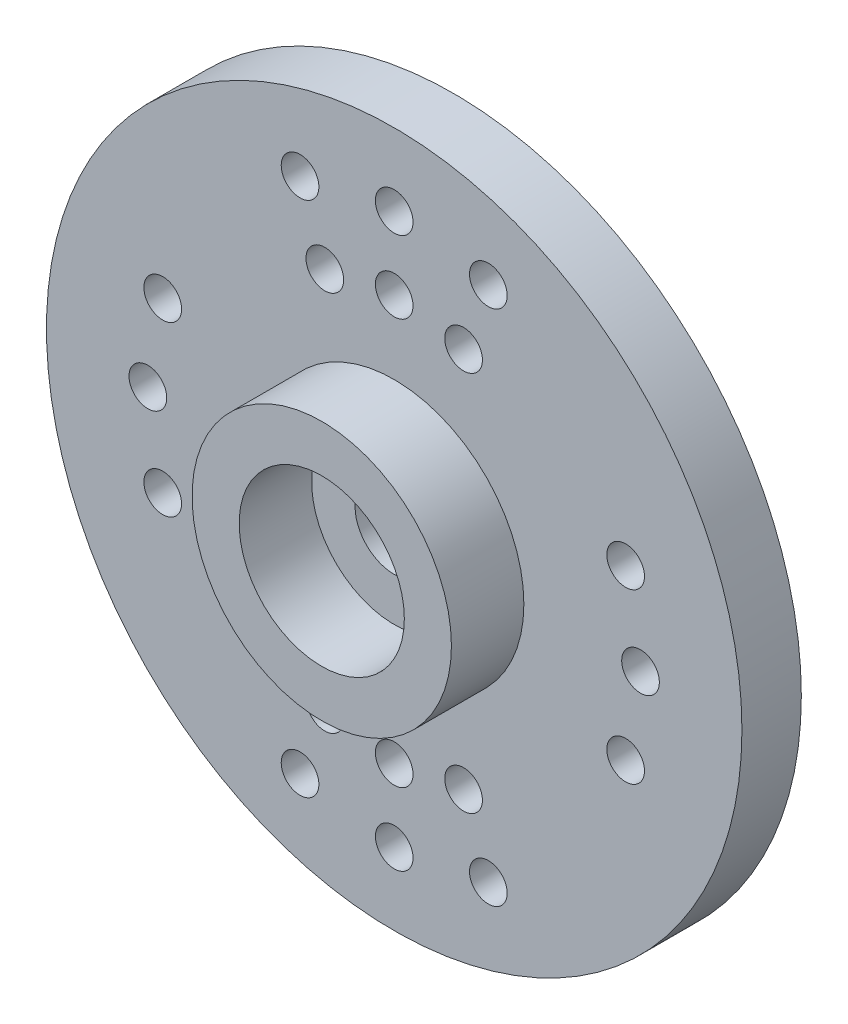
ISO-10303-21;
HEADER;
FILE_DESCRIPTION(('STEP AP214'),'2;1');
FILE_NAME('part.step','',(''),(''),'','','');
FILE_SCHEMA(('AUTOMOTIVE_DESIGN { 1 0 10303 214 1 1 1 1 }'));
ENDSEC;
DATA;
#1=APPLICATION_CONTEXT('core data for automotive mechanical design processes');
#2=APPLICATION_PROTOCOL_DEFINITION('international standard','automotive_design',2000,#1);
#3=PRODUCT_CONTEXT('',#1,'mechanical');
#4=PRODUCT('Part','Part','',(#3));
#5=PRODUCT_RELATED_PRODUCT_CATEGORY('part','',(#4));
#6=PRODUCT_DEFINITION_FORMATION('','',#4);
#7=PRODUCT_DEFINITION_CONTEXT('part definition',#1,'design');
#8=PRODUCT_DEFINITION('design','',#6,#7);
#9=PRODUCT_DEFINITION_SHAPE('','',#8);
#10=(LENGTH_UNIT() NAMED_UNIT(*) SI_UNIT(.MILLI.,.METRE.));
#11=(NAMED_UNIT(*) PLANE_ANGLE_UNIT() SI_UNIT($,.RADIAN.));
#12=(NAMED_UNIT(*) SI_UNIT($,.STERADIAN.) SOLID_ANGLE_UNIT());
#13=UNCERTAINTY_MEASURE_WITH_UNIT(LENGTH_MEASURE(1.E-05),#10,'distance_accuracy_value','');
#14=(GEOMETRIC_REPRESENTATION_CONTEXT(3) GLOBAL_UNCERTAINTY_ASSIGNED_CONTEXT((#13)) GLOBAL_UNIT_ASSIGNED_CONTEXT((#10,
#11,#12)) REPRESENTATION_CONTEXT('',''));
#15=CARTESIAN_POINT('',(0.,0.,0.));
#16=DIRECTION('',(0.,0.,1.));
#17=DIRECTION('',(1.,0.,0.));
#18=AXIS2_PLACEMENT_3D('',#15,#16,#17);
#19=CARTESIAN_POINT('',(0.,0.,2.05));
#20=DIRECTION('',(0.,0.,-1.));
#21=DIRECTION('',(-1.,0.,0.));
#22=AXIS2_PLACEMENT_3D('',#19,#20,#21);
#23=CYLINDRICAL_SURFACE('',#22,1.35);
#24=CARTESIAN_POINT('',(0.,0.,0.));
#25=DIRECTION('',(0.,0.,-1.));
#26=DIRECTION('',(-1.,0.,0.));
#27=AXIS2_PLACEMENT_3D('',#24,#25,#26);
#28=CIRCLE('',#27,1.35);
#29=CARTESIAN_POINT('',(-1.35,0.,0.));
#30=VERTEX_POINT('',#29);
#31=EDGE_CURVE('E44',#30,#30,#28,.F.);
#32=ORIENTED_EDGE('',*,*,#31,.F.);
#33=EDGE_LOOP('',(#32));
#34=FACE_BOUND('',#33,.T.);
#35=CARTESIAN_POINT('',(0.,0.,2.05));
#36=DIRECTION('',(0.,0.,-1.));
#37=DIRECTION('',(-1.,0.,0.));
#38=AXIS2_PLACEMENT_3D('',#35,#36,#37);
#39=CIRCLE('',#38,1.35);
#40=CARTESIAN_POINT('',(1.35,0.,2.05));
#41=VERTEX_POINT('',#40);
#42=EDGE_CURVE('E21',#41,#41,#39,.T.);
#43=ORIENTED_EDGE('',*,*,#42,.F.);
#44=EDGE_LOOP('',(#43));
#45=FACE_BOUND('',#44,.T.);
#46=ADVANCED_FACE('F17',(#34,#45),#23,.F.);
#47=CARTESIAN_POINT('',(-3.135,-3.135,2.05));
#48=DIRECTION('',(0.,0.,1.));
#49=DIRECTION('',(1.,0.,0.));
#50=AXIS2_PLACEMENT_3D('',#47,#48,#49);
#51=PLANE('',#50);
#52=ORIENTED_EDGE('',*,*,#42,.T.);
#53=EDGE_LOOP('',(#52));
#54=FACE_BOUND('',#53,.T.);
#55=CARTESIAN_POINT('',(0.,0.,2.05));
#56=DIRECTION('',(0.,0.,1.));
#57=DIRECTION('',(1.,0.,0.));
#58=AXIS2_PLACEMENT_3D('',#55,#56,#57);
#59=CIRCLE('',#58,2.85);
#60=CARTESIAN_POINT('',(2.85,0.,2.05));
#61=VERTEX_POINT('',#60);
#62=EDGE_CURVE('E34',#61,#61,#59,.F.);
#63=ORIENTED_EDGE('',*,*,#62,.F.);
#64=EDGE_LOOP('',(#63));
#65=FACE_BOUND('',#64,.T.);
#66=ADVANCED_FACE('F596',(#54,#65),#51,.T.);
#67=CARTESIAN_POINT('',(3.3,-3.3,0.));
#68=DIRECTION('',(0.,0.,-1.));
#69=DIRECTION('',(-1.,0.,0.));
#70=AXIS2_PLACEMENT_3D('',#67,#68,#69);
#71=PLANE('',#70);
#72=ORIENTED_EDGE('',*,*,#31,.T.);
#73=EDGE_LOOP('',(#72));
#74=FACE_BOUND('',#73,.T.);
#75=CARTESIAN_POINT('',(0.,0.,0.));
#76=DIRECTION('',(0.,0.,-1.));
#77=DIRECTION('',(-1.,0.,0.));
#78=AXIS2_PLACEMENT_3D('',#75,#76,#77);
#79=CIRCLE('',#78,3.);
#80=CARTESIAN_POINT('',(-3.,0.,0.));
#81=VERTEX_POINT('',#80);
#82=EDGE_CURVE('E52',#81,#81,#79,.F.);
#83=ORIENTED_EDGE('',*,*,#82,.F.);
#84=EDGE_LOOP('',(#83));
#85=FACE_BOUND('',#84,.T.);
#86=ADVANCED_FACE('F588',(#74,#85),#71,.T.);
#87=CARTESIAN_POINT('',(0.,0.,2.05));
#88=DIRECTION('',(0.,0.,1.));
#89=DIRECTION('',(1.,0.,0.));
#90=AXIS2_PLACEMENT_3D('',#87,#88,#89);
#91=CYLINDRICAL_SURFACE('',#90,2.85);
#92=ORIENTED_EDGE('',*,*,#62,.T.);
#93=EDGE_LOOP('',(#92));
#94=FACE_BOUND('',#93,.T.);
#95=CARTESIAN_POINT('',(0.,0.,4.55));
#96=DIRECTION('',(0.,0.,1.));
#97=DIRECTION('',(1.,0.,0.));
#98=AXIS2_PLACEMENT_3D('',#95,#96,#97);
#99=CIRCLE('',#98,2.85);
#100=CARTESIAN_POINT('',(2.85,0.,4.55));
#101=VERTEX_POINT('',#100);
#102=EDGE_CURVE('E57',#101,#101,#99,.F.);
#103=ORIENTED_EDGE('',*,*,#102,.F.);
#104=EDGE_LOOP('',(#103));
#105=FACE_BOUND('',#104,.T.);
#106=ADVANCED_FACE('F580',(#94,#105),#91,.F.);
#107=CARTESIAN_POINT('',(0.,0.,0.));
#108=DIRECTION('',(0.,0.,-1.));
#109=DIRECTION('',(-1.,0.,0.));
#110=AXIS2_PLACEMENT_3D('',#107,#108,#109);
#111=CYLINDRICAL_SURFACE('',#110,3.);
#112=ORIENTED_EDGE('',*,*,#82,.T.);
#113=EDGE_LOOP('',(#112));
#114=FACE_BOUND('',#113,.T.);
#115=CARTESIAN_POINT('',(0.,0.,-0.5));
#116=DIRECTION('',(0.,0.,-1.));
#117=DIRECTION('',(-1.,0.,0.));
#118=AXIS2_PLACEMENT_3D('',#115,#116,#117);
#119=CIRCLE('',#118,3.);
#120=CARTESIAN_POINT('',(-3.,0.,-0.5));
#121=VERTEX_POINT('',#120);
#122=EDGE_CURVE('E60',#121,#121,#119,.F.);
#123=ORIENTED_EDGE('',*,*,#122,.F.);
#124=EDGE_LOOP('',(#123));
#125=FACE_BOUND('',#124,.T.);
#126=ADVANCED_FACE('F300',(#114,#125),#111,.F.);
#127=CARTESIAN_POINT('',(-4.9225,-4.9225,4.55));
#128=DIRECTION('',(0.,0.,1.));
#129=DIRECTION('',(1.,0.,0.));
#130=AXIS2_PLACEMENT_3D('',#127,#128,#129);
#131=PLANE('',#130);
#132=ORIENTED_EDGE('',*,*,#102,.T.);
#133=EDGE_LOOP('',(#132));
#134=FACE_BOUND('',#133,.T.);
#135=CARTESIAN_POINT('',(0.,0.,4.55));
#136=DIRECTION('',(0.,0.,1.));
#137=DIRECTION('',(1.,0.,0.));
#138=AXIS2_PLACEMENT_3D('',#135,#136,#137);
#139=CIRCLE('',#138,4.475);
#140=CARTESIAN_POINT('',(4.475,0.,4.55));
#141=VERTEX_POINT('',#140);
#142=EDGE_CURVE('E63',#141,#141,#139,.F.);
#143=ORIENTED_EDGE('',*,*,#142,.F.);
#144=EDGE_LOOP('',(#143));
#145=FACE_BOUND('',#144,.T.);
#146=ADVANCED_FACE('F304',(#134,#145),#131,.T.);
#147=CARTESIAN_POINT('',(4.125,-4.125,-0.5));
#148=DIRECTION('',(0.,0.,-1.));
#149=DIRECTION('',(-1.,0.,0.));
#150=AXIS2_PLACEMENT_3D('',#147,#148,#149);
#151=PLANE('',#150);
#152=ORIENTED_EDGE('',*,*,#122,.T.);
#153=EDGE_LOOP('',(#152));
#154=FACE_BOUND('',#153,.T.);
#155=CARTESIAN_POINT('',(0.,0.,-0.5));
#156=DIRECTION('',(0.,0.,-1.));
#157=DIRECTION('',(-1.,0.,0.));
#158=AXIS2_PLACEMENT_3D('',#155,#156,#157);
#159=CIRCLE('',#158,3.75);
#160=CARTESIAN_POINT('',(-3.75,0.,-0.5));
#161=VERTEX_POINT('',#160);
#162=EDGE_CURVE('E66',#161,#161,#159,.F.);
#163=ORIENTED_EDGE('',*,*,#162,.F.);
#164=EDGE_LOOP('',(#163));
#165=FACE_BOUND('',#164,.T.);
#166=ADVANCED_FACE('F217',(#154,#165),#151,.T.);
#167=CARTESIAN_POINT('',(0.,0.,4.55));
#168=DIRECTION('',(0.,0.,1.));
#169=DIRECTION('',(1.,0.,0.));
#170=AXIS2_PLACEMENT_3D('',#167,#168,#169);
#171=CYLINDRICAL_SURFACE('',#170,4.475);
#172=CARTESIAN_POINT('',(0.,0.,2.05));
#173=DIRECTION('',(0.,0.,1.));
#174=DIRECTION('',(1.,0.,0.));
#175=AXIS2_PLACEMENT_3D('',#172,#173,#174);
#176=CIRCLE('',#175,4.475);
#177=CARTESIAN_POINT('',(4.475,0.,2.05));
#178=VERTEX_POINT('',#177);
#179=EDGE_CURVE('E123',#178,#178,#176,.F.);
#180=ORIENTED_EDGE('',*,*,#179,.F.);
#181=EDGE_LOOP('',(#180));
#182=FACE_BOUND('',#181,.T.);
#183=ORIENTED_EDGE('',*,*,#142,.T.);
#184=EDGE_LOOP('',(#183));
#185=FACE_BOUND('',#184,.T.);
#186=ADVANCED_FACE('F206',(#182,#185),#171,.T.);
#187=CARTESIAN_POINT('',(0.,0.,2.05));
#188=DIRECTION('',(0.,0.,1.));
#189=DIRECTION('',(1.,0.,0.));
#190=AXIS2_PLACEMENT_3D('',#187,#188,#189);
#191=CYLINDRICAL_SURFACE('',#190,12.);
#192=CARTESIAN_POINT('',(0.,0.,0.));
#193=DIRECTION('',(0.,0.,1.));
#194=DIRECTION('',(1.,0.,0.));
#195=AXIS2_PLACEMENT_3D('',#192,#193,#194);
#196=CIRCLE('',#195,12.);
#197=CARTESIAN_POINT('',(12.,0.,0.));
#198=VERTEX_POINT('',#197);
#199=EDGE_CURVE('E126',#198,#198,#196,.F.);
#200=ORIENTED_EDGE('',*,*,#199,.F.);
#201=EDGE_LOOP('',(#200));
#202=FACE_BOUND('',#201,.T.);
#203=CARTESIAN_POINT('',(0.,0.,2.05));
#204=DIRECTION('',(0.,0.,1.));
#205=DIRECTION('',(1.,0.,0.));
#206=AXIS2_PLACEMENT_3D('',#203,#204,#205);
#207=CIRCLE('',#206,12.);
#208=CARTESIAN_POINT('',(12.,0.,2.05));
#209=VERTEX_POINT('',#208);
#210=EDGE_CURVE('E69',#209,#209,#207,.T.);
#211=ORIENTED_EDGE('',*,*,#210,.F.);
#212=EDGE_LOOP('',(#211));
#213=FACE_BOUND('',#212,.T.);
#214=ADVANCED_FACE('F203',(#202,#213),#191,.T.);
#215=CARTESIAN_POINT('',(-7.98738727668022,-2.90717121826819,0.));
#216=DIRECTION('',(0.,0.,1.));
#217=DIRECTION('',(1.,0.,0.));
#218=AXIS2_PLACEMENT_3D('',#215,#216,#217);
#219=CYLINDRICAL_SURFACE('',#218,0.650000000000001);
#220=CARTESIAN_POINT('',(-7.98738727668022,-2.90717121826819,0.));
#221=DIRECTION('',(0.,0.,1.));
#222=DIRECTION('',(1.,0.,0.));
#223=AXIS2_PLACEMENT_3D('',#220,#221,#222);
#224=CIRCLE('',#223,0.650000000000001);
#225=CARTESIAN_POINT('',(-7.37658707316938,-2.6848581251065,0.));
#226=VERTEX_POINT('',#225);
#227=EDGE_CURVE('E129',#226,#226,#224,.T.);
#228=ORIENTED_EDGE('',*,*,#227,.F.);
#229=EDGE_LOOP('',(#228));
#230=FACE_BOUND('',#229,.T.);
#231=CARTESIAN_POINT('',(-7.98738727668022,-2.90717121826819,2.05));
#232=DIRECTION('',(0.,0.,1.));
#233=DIRECTION('',(1.,0.,0.));
#234=AXIS2_PLACEMENT_3D('',#231,#232,#233);
#235=CIRCLE('',#234,0.650000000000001);
#236=CARTESIAN_POINT('',(-8.59818748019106,-3.12948431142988,2.05));
#237=VERTEX_POINT('',#236);
#238=EDGE_CURVE('E72',#237,#237,#235,.F.);
#239=ORIENTED_EDGE('',*,*,#238,.F.);
#240=EDGE_LOOP('',(#239));
#241=FACE_BOUND('',#240,.T.);
#242=ADVANCED_FACE('F205',(#230,#241),#219,.F.);
#243=CARTESIAN_POINT('',(-8.5,0.,0.));
#244=DIRECTION('',(0.,0.,1.));
#245=DIRECTION('',(1.,0.,0.));
#246=AXIS2_PLACEMENT_3D('',#243,#244,#245);
#247=CYLINDRICAL_SURFACE('',#246,0.650000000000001);
#248=CARTESIAN_POINT('',(-8.5,0.,0.));
#249=DIRECTION('',(0.,0.,1.));
#250=DIRECTION('',(1.,0.,0.));
#251=AXIS2_PLACEMENT_3D('',#248,#249,#250);
#252=CIRCLE('',#251,0.650000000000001);
#253=CARTESIAN_POINT('',(-7.85,0.,0.));
#254=VERTEX_POINT('',#253);
#255=EDGE_CURVE('E132',#254,#254,#252,.T.);
#256=ORIENTED_EDGE('',*,*,#255,.F.);
#257=EDGE_LOOP('',(#256));
#258=FACE_BOUND('',#257,.T.);
#259=CARTESIAN_POINT('',(-8.5,0.,2.05));
#260=DIRECTION('',(0.,0.,1.));
#261=DIRECTION('',(1.,0.,0.));
#262=AXIS2_PLACEMENT_3D('',#259,#260,#261);
#263=CIRCLE('',#262,0.650000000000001);
#264=CARTESIAN_POINT('',(-9.15,0.,2.05));
#265=VERTEX_POINT('',#264);
#266=EDGE_CURVE('E75',#265,#265,#263,.F.);
#267=ORIENTED_EDGE('',*,*,#266,.F.);
#268=EDGE_LOOP('',(#267));
#269=FACE_BOUND('',#268,.T.);
#270=ADVANCED_FACE('F214',(#258,#269),#247,.F.);
#271=CARTESIAN_POINT('',(7.98738727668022,2.90717121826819,0.));
#272=DIRECTION('',(0.,0.,1.));
#273=DIRECTION('',(1.,0.,0.));
#274=AXIS2_PLACEMENT_3D('',#271,#272,#273);
#275=CYLINDRICAL_SURFACE('',#274,0.650000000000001);
#276=CARTESIAN_POINT('',(7.98738727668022,2.90717121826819,0.));
#277=DIRECTION('',(0.,0.,1.));
#278=DIRECTION('',(1.,0.,0.));
#279=AXIS2_PLACEMENT_3D('',#276,#277,#278);
#280=CIRCLE('',#279,0.650000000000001);
#281=CARTESIAN_POINT('',(7.37658707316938,2.6848581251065,0.));
#282=VERTEX_POINT('',#281);
#283=EDGE_CURVE('E135',#282,#282,#280,.T.);
#284=ORIENTED_EDGE('',*,*,#283,.F.);
#285=EDGE_LOOP('',(#284));
#286=FACE_BOUND('',#285,.T.);
#287=CARTESIAN_POINT('',(7.98738727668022,2.90717121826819,2.05));
#288=DIRECTION('',(0.,0.,1.));
#289=DIRECTION('',(1.,0.,0.));
#290=AXIS2_PLACEMENT_3D('',#287,#288,#289);
#291=CIRCLE('',#290,0.650000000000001);
#292=CARTESIAN_POINT('',(8.59818748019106,3.12948431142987,2.05));
#293=VERTEX_POINT('',#292);
#294=EDGE_CURVE('E78',#293,#293,#291,.F.);
#295=ORIENTED_EDGE('',*,*,#294,.F.);
#296=EDGE_LOOP('',(#295));
#297=FACE_BOUND('',#296,.T.);
#298=ADVANCED_FACE('F338',(#286,#297),#275,.F.);
#299=CARTESIAN_POINT('',(7.98738727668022,-2.9071712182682,2.05));
#300=DIRECTION('',(0.,0.,-1.));
#301=DIRECTION('',(-1.,0.,0.));
#302=AXIS2_PLACEMENT_3D('',#299,#300,#301);
#303=CYLINDRICAL_SURFACE('',#302,0.649999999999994);
#304=CARTESIAN_POINT('',(7.98738727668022,-2.9071712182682,0.));
#305=DIRECTION('',(0.,0.,-1.));
#306=DIRECTION('',(-1.,0.,0.));
#307=AXIS2_PLACEMENT_3D('',#304,#305,#306);
#308=CIRCLE('',#307,0.649999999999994);
#309=CARTESIAN_POINT('',(7.37658707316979,-2.6848581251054,0.));
#310=VERTEX_POINT('',#309);
#311=EDGE_CURVE('E138',#310,#310,#308,.F.);
#312=ORIENTED_EDGE('',*,*,#311,.F.);
#313=EDGE_LOOP('',(#312));
#314=FACE_BOUND('',#313,.T.);
#315=CARTESIAN_POINT('',(7.98738727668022,-2.9071712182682,2.05));
#316=DIRECTION('',(0.,0.,-1.));
#317=DIRECTION('',(-1.,0.,0.));
#318=AXIS2_PLACEMENT_3D('',#315,#316,#317);
#319=CIRCLE('',#318,0.649999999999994);
#320=CARTESIAN_POINT('',(8.59818748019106,-3.12948431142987,2.05));
#321=VERTEX_POINT('',#320);
#322=EDGE_CURVE('E81',#321,#321,#319,.T.);
#323=ORIENTED_EDGE('',*,*,#322,.F.);
#324=EDGE_LOOP('',(#323));
#325=FACE_BOUND('',#324,.T.);
#326=ADVANCED_FACE('F341',(#314,#325),#303,.F.);
#327=CARTESIAN_POINT('',(8.5,0.,2.05));
#328=DIRECTION('',(0.,0.,-1.));
#329=DIRECTION('',(-1.,0.,0.));
#330=AXIS2_PLACEMENT_3D('',#327,#328,#329);
#331=CYLINDRICAL_SURFACE('',#330,0.65);
#332=CARTESIAN_POINT('',(8.5,0.,0.));
#333=DIRECTION('',(0.,0.,-1.));
#334=DIRECTION('',(-1.,0.,0.));
#335=AXIS2_PLACEMENT_3D('',#332,#333,#334);
#336=CIRCLE('',#335,0.65);
#337=CARTESIAN_POINT('',(7.85,1.1709264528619E-12,0.));
#338=VERTEX_POINT('',#337);
#339=EDGE_CURVE('E141',#338,#338,#336,.F.);
#340=ORIENTED_EDGE('',*,*,#339,.F.);
#341=EDGE_LOOP('',(#340));
#342=FACE_BOUND('',#341,.T.);
#343=CARTESIAN_POINT('',(8.5,0.,2.05));
#344=DIRECTION('',(0.,0.,-1.));
#345=DIRECTION('',(-1.,0.,0.));
#346=AXIS2_PLACEMENT_3D('',#343,#344,#345);
#347=CIRCLE('',#346,0.65);
#348=CARTESIAN_POINT('',(9.15,0.,2.05));
#349=VERTEX_POINT('',#348);
#350=EDGE_CURVE('E84',#349,#349,#347,.T.);
#351=ORIENTED_EDGE('',*,*,#350,.F.);
#352=EDGE_LOOP('',(#351));
#353=FACE_BOUND('',#352,.T.);
#354=ADVANCED_FACE('F336',(#342,#353),#331,.F.);
#355=CARTESIAN_POINT('',(2.39414100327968,-6.57784834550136,0.));
#356=DIRECTION('',(0.,0.,1.));
#357=DIRECTION('',(1.,0.,0.));
#358=AXIS2_PLACEMENT_3D('',#355,#356,#357);
#359=CYLINDRICAL_SURFACE('',#358,0.649999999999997);
#360=CARTESIAN_POINT('',(2.39414100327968,-6.57784834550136,0.));
#361=DIRECTION('',(0.,0.,1.));
#362=DIRECTION('',(1.,0.,0.));
#363=AXIS2_PLACEMENT_3D('',#360,#361,#362);
#364=CIRCLE('',#363,0.649999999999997);
#365=CARTESIAN_POINT('',(1.78334079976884,-6.80016143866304,0.));
#366=VERTEX_POINT('',#365);
#367=EDGE_CURVE('E144',#366,#366,#364,.T.);
#368=ORIENTED_EDGE('',*,*,#367,.F.);
#369=EDGE_LOOP('',(#368));
#370=FACE_BOUND('',#369,.T.);
#371=CARTESIAN_POINT('',(2.39414100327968,-6.57784834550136,2.05));
#372=DIRECTION('',(0.,0.,1.));
#373=DIRECTION('',(1.,0.,0.));
#374=AXIS2_PLACEMENT_3D('',#371,#372,#373);
#375=CIRCLE('',#374,0.649999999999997);
#376=CARTESIAN_POINT('',(3.00494120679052,-6.35553525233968,2.05));
#377=VERTEX_POINT('',#376);
#378=EDGE_CURVE('E87',#377,#377,#375,.F.);
#379=ORIENTED_EDGE('',*,*,#378,.F.);
#380=EDGE_LOOP('',(#379));
#381=FACE_BOUND('',#380,.T.);
#382=ADVANCED_FACE('F332',(#370,#381),#359,.F.);
#383=CARTESIAN_POINT('',(3.24919136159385,-8.92707989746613,0.));
#384=DIRECTION('',(0.,0.,1.));
#385=DIRECTION('',(1.,0.,0.));
#386=AXIS2_PLACEMENT_3D('',#383,#384,#385);
#387=CYLINDRICAL_SURFACE('',#386,0.649999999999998);
#388=CARTESIAN_POINT('',(3.24919136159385,-8.92707989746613,0.));
#389=DIRECTION('',(0.,0.,1.));
#390=DIRECTION('',(1.,0.,0.));
#391=AXIS2_PLACEMENT_3D('',#388,#389,#390);
#392=CIRCLE('',#391,0.649999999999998);
#393=CARTESIAN_POINT('',(2.63839115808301,-9.14939299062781,0.));
#394=VERTEX_POINT('',#393);
#395=EDGE_CURVE('E147',#394,#394,#392,.T.);
#396=ORIENTED_EDGE('',*,*,#395,.F.);
#397=EDGE_LOOP('',(#396));
#398=FACE_BOUND('',#397,.T.);
#399=CARTESIAN_POINT('',(3.24919136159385,-8.92707989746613,2.05));
#400=DIRECTION('',(0.,0.,1.));
#401=DIRECTION('',(1.,0.,0.));
#402=AXIS2_PLACEMENT_3D('',#399,#400,#401);
#403=CIRCLE('',#402,0.649999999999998);
#404=CARTESIAN_POINT('',(3.85999156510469,-8.70476680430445,2.05));
#405=VERTEX_POINT('',#404);
#406=EDGE_CURVE('E90',#405,#405,#403,.F.);
#407=ORIENTED_EDGE('',*,*,#406,.F.);
#408=EDGE_LOOP('',(#407));
#409=FACE_BOUND('',#408,.T.);
#410=ADVANCED_FACE('F328',(#398,#409),#387,.F.);
#411=CARTESIAN_POINT('',(-2.39414100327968,-6.57784834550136,2.04999999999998));
#412=DIRECTION('',(0.,0.,-1.));
#413=DIRECTION('',(-1.,0.,0.));
#414=AXIS2_PLACEMENT_3D('',#411,#412,#413);
#415=CYLINDRICAL_SURFACE('',#414,0.649999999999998);
#416=CARTESIAN_POINT('',(-2.39414100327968,-6.57784834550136,0.));
#417=DIRECTION('',(0.,0.,-1.));
#418=DIRECTION('',(-1.,0.,0.));
#419=AXIS2_PLACEMENT_3D('',#416,#417,#418);
#420=CIRCLE('',#419,0.649999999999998);
#421=CARTESIAN_POINT('',(-1.78334079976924,-6.80016143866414,0.));
#422=VERTEX_POINT('',#421);
#423=EDGE_CURVE('E150',#422,#422,#420,.F.);
#424=ORIENTED_EDGE('',*,*,#423,.F.);
#425=EDGE_LOOP('',(#424));
#426=FACE_BOUND('',#425,.T.);
#427=CARTESIAN_POINT('',(-2.39414100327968,-6.57784834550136,2.05));
#428=DIRECTION('',(0.,0.,-1.));
#429=DIRECTION('',(-1.,0.,0.));
#430=AXIS2_PLACEMENT_3D('',#427,#428,#429);
#431=CIRCLE('',#430,0.649999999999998);
#432=CARTESIAN_POINT('',(-3.00494120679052,-6.35553525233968,2.05));
#433=VERTEX_POINT('',#432);
#434=EDGE_CURVE('E93',#433,#433,#431,.T.);
#435=ORIENTED_EDGE('',*,*,#434,.F.);
#436=EDGE_LOOP('',(#435));
#437=FACE_BOUND('',#436,.T.);
#438=ADVANCED_FACE('F331',(#426,#437),#415,.F.);
#439=CARTESIAN_POINT('',(-3.24919136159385,-8.92707989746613,2.04999999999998));
#440=DIRECTION('',(0.,0.,-1.));
#441=DIRECTION('',(-1.,0.,0.));
#442=AXIS2_PLACEMENT_3D('',#439,#440,#441);
#443=CYLINDRICAL_SURFACE('',#442,0.649999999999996);
#444=CARTESIAN_POINT('',(-3.24919136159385,-8.92707989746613,0.));
#445=DIRECTION('',(0.,0.,-1.));
#446=DIRECTION('',(-1.,0.,0.));
#447=AXIS2_PLACEMENT_3D('',#444,#445,#446);
#448=CIRCLE('',#447,0.649999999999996);
#449=CARTESIAN_POINT('',(-2.63839115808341,-9.14939299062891,0.));
#450=VERTEX_POINT('',#449);
#451=EDGE_CURVE('E153',#450,#450,#448,.F.);
#452=ORIENTED_EDGE('',*,*,#451,.F.);
#453=EDGE_LOOP('',(#452));
#454=FACE_BOUND('',#453,.T.);
#455=CARTESIAN_POINT('',(-3.24919136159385,-8.92707989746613,2.05));
#456=DIRECTION('',(0.,0.,-1.));
#457=DIRECTION('',(-1.,0.,0.));
#458=AXIS2_PLACEMENT_3D('',#455,#456,#457);
#459=CIRCLE('',#458,0.649999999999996);
#460=CARTESIAN_POINT('',(-3.85999156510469,-8.70476680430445,2.05));
#461=VERTEX_POINT('',#460);
#462=EDGE_CURVE('E96',#461,#461,#459,.T.);
#463=ORIENTED_EDGE('',*,*,#462,.F.);
#464=EDGE_LOOP('',(#463));
#465=FACE_BOUND('',#464,.T.);
#466=ADVANCED_FACE('F432',(#454,#465),#443,.F.);
#467=CARTESIAN_POINT('',(0.,-7.,2.05));
#468=DIRECTION('',(0.,0.,-1.));
#469=DIRECTION('',(-1.,0.,0.));
#470=AXIS2_PLACEMENT_3D('',#467,#468,#469);
#471=CYLINDRICAL_SURFACE('',#470,0.65);
#472=CARTESIAN_POINT('',(0.,-7.,0.));
#473=DIRECTION('',(0.,0.,-1.));
#474=DIRECTION('',(-1.,0.,0.));
#475=AXIS2_PLACEMENT_3D('',#472,#473,#474);
#476=CIRCLE('',#475,0.65);
#477=CARTESIAN_POINT('',(0.650000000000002,-7.00000000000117,0.));
#478=VERTEX_POINT('',#477);
#479=EDGE_CURVE('E156',#478,#478,#476,.F.);
#480=ORIENTED_EDGE('',*,*,#479,.F.);
#481=EDGE_LOOP('',(#480));
#482=FACE_BOUND('',#481,.T.);
#483=CARTESIAN_POINT('',(0.,-7.,2.05));
#484=DIRECTION('',(0.,0.,-1.));
#485=DIRECTION('',(-1.,0.,0.));
#486=AXIS2_PLACEMENT_3D('',#483,#484,#485);
#487=CIRCLE('',#486,0.65);
#488=CARTESIAN_POINT('',(-0.649999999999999,-7.,2.05));
#489=VERTEX_POINT('',#488);
#490=EDGE_CURVE('E99',#489,#489,#487,.T.);
#491=ORIENTED_EDGE('',*,*,#490,.F.);
#492=EDGE_LOOP('',(#491));
#493=FACE_BOUND('',#492,.T.);
#494=ADVANCED_FACE('F436',(#482,#493),#471,.F.);
#495=CARTESIAN_POINT('',(0.,-9.5,2.05));
#496=DIRECTION('',(0.,0.,-1.));
#497=DIRECTION('',(-1.,0.,0.));
#498=AXIS2_PLACEMENT_3D('',#495,#496,#497);
#499=CYLINDRICAL_SURFACE('',#498,0.649999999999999);
#500=CARTESIAN_POINT('',(0.,-9.5,0.));
#501=DIRECTION('',(0.,0.,-1.));
#502=DIRECTION('',(-1.,0.,0.));
#503=AXIS2_PLACEMENT_3D('',#500,#501,#502);
#504=CIRCLE('',#503,0.649999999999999);
#505=CARTESIAN_POINT('',(0.65,-9.50000000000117,0.));
#506=VERTEX_POINT('',#505);
#507=EDGE_CURVE('E159',#506,#506,#504,.F.);
#508=ORIENTED_EDGE('',*,*,#507,.F.);
#509=EDGE_LOOP('',(#508));
#510=FACE_BOUND('',#509,.T.);
#511=CARTESIAN_POINT('',(0.,-9.5,2.05));
#512=DIRECTION('',(0.,0.,-1.));
#513=DIRECTION('',(-1.,0.,0.));
#514=AXIS2_PLACEMENT_3D('',#511,#512,#513);
#515=CIRCLE('',#514,0.649999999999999);
#516=CARTESIAN_POINT('',(-0.649999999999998,-9.5,2.05));
#517=VERTEX_POINT('',#516);
#518=EDGE_CURVE('E102',#517,#517,#515,.T.);
#519=ORIENTED_EDGE('',*,*,#518,.F.);
#520=EDGE_LOOP('',(#519));
#521=FACE_BOUND('',#520,.T.);
#522=ADVANCED_FACE('F326',(#510,#521),#499,.F.);
#523=CARTESIAN_POINT('',(-2.39414100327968,6.57784834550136,0.));
#524=DIRECTION('',(0.,0.,1.));
#525=DIRECTION('',(1.,0.,0.));
#526=AXIS2_PLACEMENT_3D('',#523,#524,#525);
#527=CYLINDRICAL_SURFACE('',#526,0.649999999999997);
#528=CARTESIAN_POINT('',(-2.39414100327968,6.57784834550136,0.));
#529=DIRECTION('',(0.,0.,1.));
#530=DIRECTION('',(1.,0.,0.));
#531=AXIS2_PLACEMENT_3D('',#528,#529,#530);
#532=CIRCLE('',#531,0.649999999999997);
#533=CARTESIAN_POINT('',(-1.78334079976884,6.80016143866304,0.));
#534=VERTEX_POINT('',#533);
#535=EDGE_CURVE('E162',#534,#534,#532,.T.);
#536=ORIENTED_EDGE('',*,*,#535,.F.);
#537=EDGE_LOOP('',(#536));
#538=FACE_BOUND('',#537,.T.);
#539=CARTESIAN_POINT('',(-2.39414100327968,6.57784834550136,2.05));
#540=DIRECTION('',(0.,0.,1.));
#541=DIRECTION('',(1.,0.,0.));
#542=AXIS2_PLACEMENT_3D('',#539,#540,#541);
#543=CIRCLE('',#542,0.649999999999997);
#544=CARTESIAN_POINT('',(-3.00494120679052,6.35553525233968,2.05));
#545=VERTEX_POINT('',#544);
#546=EDGE_CURVE('E105',#545,#545,#543,.F.);
#547=ORIENTED_EDGE('',*,*,#546,.F.);
#548=EDGE_LOOP('',(#547));
#549=FACE_BOUND('',#548,.T.);
#550=ADVANCED_FACE('F322',(#538,#549),#527,.F.);
#551=CARTESIAN_POINT('',(-3.24919136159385,8.92707989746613,0.));
#552=DIRECTION('',(0.,0.,1.));
#553=DIRECTION('',(1.,0.,0.));
#554=AXIS2_PLACEMENT_3D('',#551,#552,#553);
#555=CYLINDRICAL_SURFACE('',#554,0.649999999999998);
#556=CARTESIAN_POINT('',(-3.24919136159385,8.92707989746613,0.));
#557=DIRECTION('',(0.,0.,1.));
#558=DIRECTION('',(1.,0.,0.));
#559=AXIS2_PLACEMENT_3D('',#556,#557,#558);
#560=CIRCLE('',#559,0.649999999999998);
#561=CARTESIAN_POINT('',(-2.63839115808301,9.14939299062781,0.));
#562=VERTEX_POINT('',#561);
#563=EDGE_CURVE('E165',#562,#562,#560,.T.);
#564=ORIENTED_EDGE('',*,*,#563,.F.);
#565=EDGE_LOOP('',(#564));
#566=FACE_BOUND('',#565,.T.);
#567=CARTESIAN_POINT('',(-3.24919136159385,8.92707989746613,2.05));
#568=DIRECTION('',(0.,0.,1.));
#569=DIRECTION('',(1.,0.,0.));
#570=AXIS2_PLACEMENT_3D('',#567,#568,#569);
#571=CIRCLE('',#570,0.649999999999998);
#572=CARTESIAN_POINT('',(-3.85999156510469,8.70476680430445,2.05));
#573=VERTEX_POINT('',#572);
#574=EDGE_CURVE('E108',#573,#573,#571,.F.);
#575=ORIENTED_EDGE('',*,*,#574,.F.);
#576=EDGE_LOOP('',(#575));
#577=FACE_BOUND('',#576,.T.);
#578=ADVANCED_FACE('F318',(#566,#577),#555,.F.);
#579=CARTESIAN_POINT('',(2.39414100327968,6.57784834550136,2.05));
#580=DIRECTION('',(0.,0.,-1.));
#581=DIRECTION('',(-1.,0.,0.));
#582=AXIS2_PLACEMENT_3D('',#579,#580,#581);
#583=CYLINDRICAL_SURFACE('',#582,0.649999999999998);
#584=CARTESIAN_POINT('',(2.39414100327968,6.57784834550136,0.));
#585=DIRECTION('',(0.,0.,-1.));
#586=DIRECTION('',(-1.,0.,0.));
#587=AXIS2_PLACEMENT_3D('',#584,#585,#586);
#588=CIRCLE('',#587,0.649999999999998);
#589=CARTESIAN_POINT('',(1.78334079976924,6.80016143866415,0.));
#590=VERTEX_POINT('',#589);
#591=EDGE_CURVE('E168',#590,#590,#588,.F.);
#592=ORIENTED_EDGE('',*,*,#591,.F.);
#593=EDGE_LOOP('',(#592));
#594=FACE_BOUND('',#593,.T.);
#595=CARTESIAN_POINT('',(2.39414100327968,6.57784834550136,2.05));
#596=DIRECTION('',(0.,0.,-1.));
#597=DIRECTION('',(-1.,0.,0.));
#598=AXIS2_PLACEMENT_3D('',#595,#596,#597);
#599=CIRCLE('',#598,0.649999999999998);
#600=CARTESIAN_POINT('',(3.00494120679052,6.35553525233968,2.05));
#601=VERTEX_POINT('',#600);
#602=EDGE_CURVE('E111',#601,#601,#599,.T.);
#603=ORIENTED_EDGE('',*,*,#602,.F.);
#604=EDGE_LOOP('',(#603));
#605=FACE_BOUND('',#604,.T.);
#606=ADVANCED_FACE('F321',(#594,#605),#583,.F.);
#607=CARTESIAN_POINT('',(3.24919136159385,8.92707989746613,2.05));
#608=DIRECTION('',(0.,0.,-1.));
#609=DIRECTION('',(-1.,0.,0.));
#610=AXIS2_PLACEMENT_3D('',#607,#608,#609);
#611=CYLINDRICAL_SURFACE('',#610,0.649999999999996);
#612=CARTESIAN_POINT('',(3.24919136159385,8.92707989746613,0.));
#613=DIRECTION('',(0.,0.,-1.));
#614=DIRECTION('',(-1.,0.,0.));
#615=AXIS2_PLACEMENT_3D('',#612,#613,#614);
#616=CIRCLE('',#615,0.649999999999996);
#617=CARTESIAN_POINT('',(2.63839115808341,9.14939299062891,0.));
#618=VERTEX_POINT('',#617);
#619=EDGE_CURVE('E171',#618,#618,#616,.F.);
#620=ORIENTED_EDGE('',*,*,#619,.F.);
#621=EDGE_LOOP('',(#620));
#622=FACE_BOUND('',#621,.T.);
#623=CARTESIAN_POINT('',(3.24919136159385,8.92707989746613,2.05));
#624=DIRECTION('',(0.,0.,-1.));
#625=DIRECTION('',(-1.,0.,0.));
#626=AXIS2_PLACEMENT_3D('',#623,#624,#625);
#627=CIRCLE('',#626,0.649999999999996);
#628=CARTESIAN_POINT('',(3.85999156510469,8.70476680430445,2.05));
#629=VERTEX_POINT('',#628);
#630=EDGE_CURVE('E114',#629,#629,#627,.T.);
#631=ORIENTED_EDGE('',*,*,#630,.F.);
#632=EDGE_LOOP('',(#631));
#633=FACE_BOUND('',#632,.T.);
#634=ADVANCED_FACE('F446',(#622,#633),#611,.F.);
#635=CARTESIAN_POINT('',(0.,7.,2.05));
#636=DIRECTION('',(0.,0.,-1.));
#637=DIRECTION('',(-1.,0.,0.));
#638=AXIS2_PLACEMENT_3D('',#635,#636,#637);
#639=CYLINDRICAL_SURFACE('',#638,0.65);
#640=CARTESIAN_POINT('',(0.,7.,0.));
#641=DIRECTION('',(0.,0.,-1.));
#642=DIRECTION('',(-1.,0.,0.));
#643=AXIS2_PLACEMENT_3D('',#640,#641,#642);
#644=CIRCLE('',#643,0.65);
#645=CARTESIAN_POINT('',(-0.650000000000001,7.00000000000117,0.));
#646=VERTEX_POINT('',#645);
#647=EDGE_CURVE('E174',#646,#646,#644,.F.);
#648=ORIENTED_EDGE('',*,*,#647,.F.);
#649=EDGE_LOOP('',(#648));
#650=FACE_BOUND('',#649,.T.);
#651=CARTESIAN_POINT('',(0.,7.,2.05));
#652=DIRECTION('',(0.,0.,-1.));
#653=DIRECTION('',(-1.,0.,0.));
#654=AXIS2_PLACEMENT_3D('',#651,#652,#653);
#655=CIRCLE('',#654,0.65);
#656=CARTESIAN_POINT('',(0.65,7.,2.05));
#657=VERTEX_POINT('',#656);
#658=EDGE_CURVE('E117',#657,#657,#655,.T.);
#659=ORIENTED_EDGE('',*,*,#658,.F.);
#660=EDGE_LOOP('',(#659));
#661=FACE_BOUND('',#660,.T.);
#662=ADVANCED_FACE('F314',(#650,#661),#639,.F.);
#663=CARTESIAN_POINT('',(0.,9.5,2.05));
#664=DIRECTION('',(0.,0.,-1.));
#665=DIRECTION('',(-1.,0.,0.));
#666=AXIS2_PLACEMENT_3D('',#663,#664,#665);
#667=CYLINDRICAL_SURFACE('',#666,0.649999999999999);
#668=CARTESIAN_POINT('',(0.,9.5,0.));
#669=DIRECTION('',(0.,0.,-1.));
#670=DIRECTION('',(-1.,0.,0.));
#671=AXIS2_PLACEMENT_3D('',#668,#669,#670);
#672=CIRCLE('',#671,0.649999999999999);
#673=CARTESIAN_POINT('',(-0.649999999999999,9.50000000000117,0.));
#674=VERTEX_POINT('',#673);
#675=EDGE_CURVE('E177',#674,#674,#672,.F.);
#676=ORIENTED_EDGE('',*,*,#675,.F.);
#677=EDGE_LOOP('',(#676));
#678=FACE_BOUND('',#677,.T.);
#679=CARTESIAN_POINT('',(0.,9.5,2.05));
#680=DIRECTION('',(0.,0.,-1.));
#681=DIRECTION('',(-1.,0.,0.));
#682=AXIS2_PLACEMENT_3D('',#679,#680,#681);
#683=CIRCLE('',#682,0.649999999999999);
#684=CARTESIAN_POINT('',(0.649999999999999,9.5,2.05));
#685=VERTEX_POINT('',#684);
#686=EDGE_CURVE('E120',#685,#685,#683,.T.);
#687=ORIENTED_EDGE('',*,*,#686,.F.);
#688=EDGE_LOOP('',(#687));
#689=FACE_BOUND('',#688,.T.);
#690=ADVANCED_FACE('F308',(#678,#689),#667,.F.);
#691=CARTESIAN_POINT('',(0.,0.,-0.5));
#692=DIRECTION('',(0.,0.,-1.));
#693=DIRECTION('',(-1.,0.,0.));
#694=AXIS2_PLACEMENT_3D('',#691,#692,#693);
#695=CYLINDRICAL_SURFACE('',#694,3.75);
#696=CARTESIAN_POINT('',(0.,0.,0.));
#697=DIRECTION('',(0.,0.,-1.));
#698=DIRECTION('',(-1.,0.,0.));
#699=AXIS2_PLACEMENT_3D('',#696,#697,#698);
#700=CIRCLE('',#699,3.75);
#701=CARTESIAN_POINT('',(-3.75,0.,0.));
#702=VERTEX_POINT('',#701);
#703=EDGE_CURVE('E180',#702,#702,#700,.F.);
#704=ORIENTED_EDGE('',*,*,#703,.F.);
#705=EDGE_LOOP('',(#704));
#706=FACE_BOUND('',#705,.T.);
#707=ORIENTED_EDGE('',*,*,#162,.T.);
#708=EDGE_LOOP('',(#707));
#709=FACE_BOUND('',#708,.T.);
#710=ADVANCED_FACE('F195',(#706,#709),#695,.T.);
#711=CARTESIAN_POINT('',(-13.2,-13.2,2.05));
#712=DIRECTION('',(0.,0.,1.));
#713=DIRECTION('',(1.,0.,0.));
#714=AXIS2_PLACEMENT_3D('',#711,#712,#713);
#715=PLANE('',#714);
#716=ORIENTED_EDGE('',*,*,#179,.T.);
#717=EDGE_LOOP('',(#716));
#718=FACE_BOUND('',#717,.T.);
#719=ORIENTED_EDGE('',*,*,#686,.T.);
#720=EDGE_LOOP('',(#719));
#721=FACE_BOUND('',#720,.T.);
#722=ORIENTED_EDGE('',*,*,#658,.T.);
#723=EDGE_LOOP('',(#722));
#724=FACE_BOUND('',#723,.T.);
#725=ORIENTED_EDGE('',*,*,#630,.T.);
#726=EDGE_LOOP('',(#725));
#727=FACE_BOUND('',#726,.T.);
#728=ORIENTED_EDGE('',*,*,#602,.T.);
#729=EDGE_LOOP('',(#728));
#730=FACE_BOUND('',#729,.T.);
#731=ORIENTED_EDGE('',*,*,#574,.T.);
#732=EDGE_LOOP('',(#731));
#733=FACE_BOUND('',#732,.T.);
#734=ORIENTED_EDGE('',*,*,#546,.T.);
#735=EDGE_LOOP('',(#734));
#736=FACE_BOUND('',#735,.T.);
#737=ORIENTED_EDGE('',*,*,#518,.T.);
#738=EDGE_LOOP('',(#737));
#739=FACE_BOUND('',#738,.T.);
#740=ORIENTED_EDGE('',*,*,#490,.T.);
#741=EDGE_LOOP('',(#740));
#742=FACE_BOUND('',#741,.T.);
#743=ORIENTED_EDGE('',*,*,#462,.T.);
#744=EDGE_LOOP('',(#743));
#745=FACE_BOUND('',#744,.T.);
#746=ORIENTED_EDGE('',*,*,#434,.T.);
#747=EDGE_LOOP('',(#746));
#748=FACE_BOUND('',#747,.T.);
#749=ORIENTED_EDGE('',*,*,#406,.T.);
#750=EDGE_LOOP('',(#749));
#751=FACE_BOUND('',#750,.T.);
#752=ORIENTED_EDGE('',*,*,#378,.T.);
#753=EDGE_LOOP('',(#752));
#754=FACE_BOUND('',#753,.T.);
#755=ORIENTED_EDGE('',*,*,#350,.T.);
#756=EDGE_LOOP('',(#755));
#757=FACE_BOUND('',#756,.T.);
#758=ORIENTED_EDGE('',*,*,#322,.T.);
#759=EDGE_LOOP('',(#758));
#760=FACE_BOUND('',#759,.T.);
#761=ORIENTED_EDGE('',*,*,#294,.T.);
#762=EDGE_LOOP('',(#761));
#763=FACE_BOUND('',#762,.T.);
#764=ORIENTED_EDGE('',*,*,#266,.T.);
#765=EDGE_LOOP('',(#764));
#766=FACE_BOUND('',#765,.T.);
#767=ORIENTED_EDGE('',*,*,#238,.T.);
#768=EDGE_LOOP('',(#767));
#769=FACE_BOUND('',#768,.T.);
#770=CARTESIAN_POINT('',(-7.98738727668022,2.9071712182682,2.05));
#771=DIRECTION('',(0.,0.,-1.));
#772=DIRECTION('',(-1.,0.,0.));
#773=AXIS2_PLACEMENT_3D('',#770,#771,#772);
#774=CIRCLE('',#773,0.649999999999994);
#775=CARTESIAN_POINT('',(-8.59818748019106,3.12948431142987,2.05));
#776=VERTEX_POINT('',#775);
#777=EDGE_CURVE('E27',#776,#776,#774,.F.);
#778=ORIENTED_EDGE('',*,*,#777,.F.);
#779=EDGE_LOOP('',(#778));
#780=FACE_BOUND('',#779,.T.);
#781=ORIENTED_EDGE('',*,*,#210,.T.);
#782=EDGE_LOOP('',(#781));
#783=FACE_BOUND('',#782,.T.);
#784=ADVANCED_FACE('F191',(#718,#721,#724,#727,#730,#733,#736,#739,#742,#745,#748,#751,#754,
#757,#760,#763,#766,#769,#780,#783),#715,.T.);
#785=CARTESIAN_POINT('',(13.2,-13.2,0.));
#786=DIRECTION('',(0.,0.,-1.));
#787=DIRECTION('',(-1.,0.,0.));
#788=AXIS2_PLACEMENT_3D('',#785,#786,#787);
#789=PLANE('',#788);
#790=ORIENTED_EDGE('',*,*,#703,.T.);
#791=EDGE_LOOP('',(#790));
#792=FACE_BOUND('',#791,.T.);
#793=ORIENTED_EDGE('',*,*,#675,.T.);
#794=EDGE_LOOP('',(#793));
#795=FACE_BOUND('',#794,.T.);
#796=ORIENTED_EDGE('',*,*,#647,.T.);
#797=EDGE_LOOP('',(#796));
#798=FACE_BOUND('',#797,.T.);
#799=ORIENTED_EDGE('',*,*,#619,.T.);
#800=EDGE_LOOP('',(#799));
#801=FACE_BOUND('',#800,.T.);
#802=ORIENTED_EDGE('',*,*,#591,.T.);
#803=EDGE_LOOP('',(#802));
#804=FACE_BOUND('',#803,.T.);
#805=ORIENTED_EDGE('',*,*,#563,.T.);
#806=EDGE_LOOP('',(#805));
#807=FACE_BOUND('',#806,.T.);
#808=ORIENTED_EDGE('',*,*,#535,.T.);
#809=EDGE_LOOP('',(#808));
#810=FACE_BOUND('',#809,.T.);
#811=ORIENTED_EDGE('',*,*,#507,.T.);
#812=EDGE_LOOP('',(#811));
#813=FACE_BOUND('',#812,.T.);
#814=ORIENTED_EDGE('',*,*,#479,.T.);
#815=EDGE_LOOP('',(#814));
#816=FACE_BOUND('',#815,.T.);
#817=ORIENTED_EDGE('',*,*,#451,.T.);
#818=EDGE_LOOP('',(#817));
#819=FACE_BOUND('',#818,.T.);
#820=ORIENTED_EDGE('',*,*,#423,.T.);
#821=EDGE_LOOP('',(#820));
#822=FACE_BOUND('',#821,.T.);
#823=ORIENTED_EDGE('',*,*,#395,.T.);
#824=EDGE_LOOP('',(#823));
#825=FACE_BOUND('',#824,.T.);
#826=ORIENTED_EDGE('',*,*,#367,.T.);
#827=EDGE_LOOP('',(#826));
#828=FACE_BOUND('',#827,.T.);
#829=ORIENTED_EDGE('',*,*,#339,.T.);
#830=EDGE_LOOP('',(#829));
#831=FACE_BOUND('',#830,.T.);
#832=ORIENTED_EDGE('',*,*,#311,.T.);
#833=EDGE_LOOP('',(#832));
#834=FACE_BOUND('',#833,.T.);
#835=ORIENTED_EDGE('',*,*,#283,.T.);
#836=EDGE_LOOP('',(#835));
#837=FACE_BOUND('',#836,.T.);
#838=ORIENTED_EDGE('',*,*,#255,.T.);
#839=EDGE_LOOP('',(#838));
#840=FACE_BOUND('',#839,.T.);
#841=ORIENTED_EDGE('',*,*,#227,.T.);
#842=EDGE_LOOP('',(#841));
#843=FACE_BOUND('',#842,.T.);
#844=CARTESIAN_POINT('',(-7.98738727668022,2.9071712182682,0.));
#845=DIRECTION('',(0.,0.,-1.));
#846=DIRECTION('',(-1.,0.,0.));
#847=AXIS2_PLACEMENT_3D('',#844,#845,#846);
#848=CIRCLE('',#847,0.649999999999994);
#849=CARTESIAN_POINT('',(-7.37658707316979,2.6848581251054,0.));
#850=VERTEX_POINT('',#849);
#851=EDGE_CURVE('E11',#850,#850,#848,.T.);
#852=ORIENTED_EDGE('',*,*,#851,.F.);
#853=EDGE_LOOP('',(#852));
#854=FACE_BOUND('',#853,.T.);
#855=ORIENTED_EDGE('',*,*,#199,.T.);
#856=EDGE_LOOP('',(#855));
#857=FACE_BOUND('',#856,.T.);
#858=ADVANCED_FACE('F194',(#792,#795,#798,#801,#804,#807,#810,#813,#816,#819,#822,#825,#828,
#831,#834,#837,#840,#843,#854,#857),#789,.T.);
#859=CARTESIAN_POINT('',(-7.98738727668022,2.9071712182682,2.05));
#860=DIRECTION('',(0.,0.,-1.));
#861=DIRECTION('',(-1.,0.,0.));
#862=AXIS2_PLACEMENT_3D('',#859,#860,#861);
#863=CYLINDRICAL_SURFACE('',#862,0.649999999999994);
#864=ORIENTED_EDGE('',*,*,#851,.T.);
#865=EDGE_LOOP('',(#864));
#866=FACE_BOUND('',#865,.T.);
#867=ORIENTED_EDGE('',*,*,#777,.T.);
#868=EDGE_LOOP('',(#867));
#869=FACE_BOUND('',#868,.T.);
#870=ADVANCED_FACE('F19',(#866,#869),#863,.F.);
#871=CLOSED_SHELL('',(#46,#66,#86,#106,#126,#146,#166,#186,#214,#242,#270,#298,#326,#354,#382,
#410,#438,#466,#494,#522,#550,#578,#606,#634,#662,#690,#710,#784,#858,#870));
#872=MANIFOLD_SOLID_BREP('B1',#871);
#873=ADVANCED_BREP_SHAPE_REPRESENTATION('',(#18,#872),#14);
#874=SHAPE_DEFINITION_REPRESENTATION(#9,#873);
ENDSEC;
END-ISO-10303-21;
